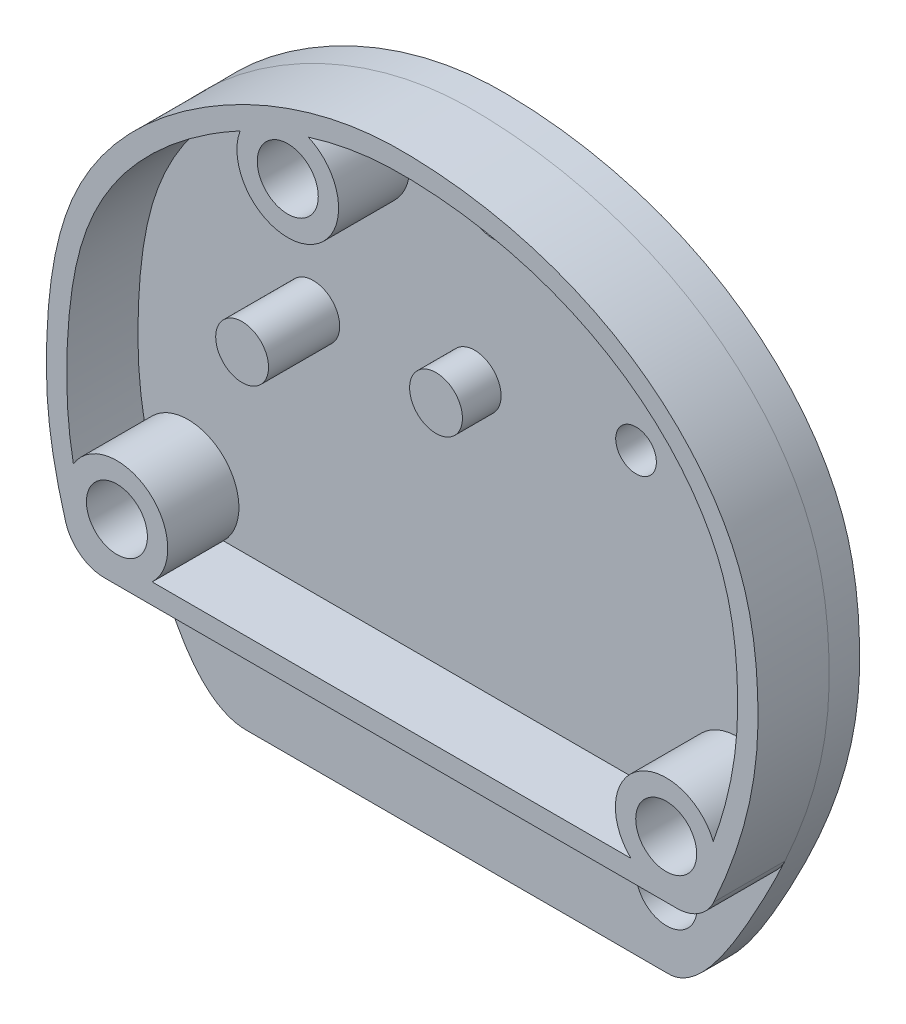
from build123d import *

# Parameters (mm, degrees)
ESQUISSE1_R      = 1.5
ESQUISSE1_R_2    = 1
EXTRUSION1_DEPTH = 1.5
EXTRUSION2_DEPTH = 3.5
ESQUISSE6_R      = 2.5
ESQUISSE6_R_2    = 1.5
EXTRUSION5_DEPTH = 3.5
ESQUISSE7_R      = 1.3
EXTRUSION6_DEPTH = 1.9
ESQUISSE7_3_R    = 1.3
EXTRUSION7_DEPTH = 3.5


with BuildPart() as part:
    # Esquisse1 → Extrusion1 (new body)
    with BuildSketch(Plane.XY):
        with BuildLine():
            add(Edge.make_bspline(
                [(-3.3971797, 11.394071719), (-3.395513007, 8.68662854), (-2.370480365, 4.05510623), (0.54355257, -2.679105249), (9.441377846, -2.667372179), (18.848986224, -2.667372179), (25.131099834, -2.678468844), (29.726189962, 4.570315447), (31.606721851, 10.113449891), (31.601256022, 15.563967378), (31.227270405, 20.572792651), (25.267008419, 27.659845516), (17.9103775, 29.32863948), (10.672863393, 29.320243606), (4.099449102, 27.082365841), (-2.82924192, 20.180658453), (-3.398796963, 14.021218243), (-3.3971797, 11.394071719)],
                knots=[0, 0, 0, 0, 0.075095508, 0.145707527, 0.145707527, 0.335877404, 0.335877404, 0.392344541, 0.508788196, 0.508788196, 0.555474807, 0.636980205, 0.746884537, 0.746884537, 0.838992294, 0.927131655, 1, 1, 1, 1], degree=3))
        make_face()
        with Locations((15.1028203, 25.824071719)):
            Circle(ESQUISSE1_R, mode=Mode.SUBTRACT)
        with Locations((22.1028203, 18.824071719)):
            Circle(ESQUISSE1_R_2, mode=Mode.SUBTRACT)
        with Locations((23.6028203, 0.824071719)):
            Circle(ESQUISSE1_R, mode=Mode.SUBTRACT)
    extrude(amount=-EXTRUSION1_DEPTH)

    # Esquisse2 → Extrusion2 (add)
    with BuildSketch(Plane(origin=(0, 0, 0), x_dir=(-1, 0, 0), z_dir=(0, 0, -1))):
        with BuildLine():
            Line((-27.606344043, 3.824071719), (0.534966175, 3.824071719))
            ThreePointArc((0.534966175, 3.824071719), (1.733661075, 4.223093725), (2.454050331, 5.260941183))
            add(Edge.make_bspline(
                [(2.454050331, 5.260941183), (3.077640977, 7.386066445), (3.395886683, 9.293643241), (3.3971797, 11.394071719), (3.398796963, 14.021218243), (2.82924192, 20.180658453), (-4.099449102, 27.082365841), (-10.672863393, 29.320243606), (-17.9103775, 29.32863948), (-25.267008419, 27.659845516), (-31.227270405, 20.572792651), (-31.601256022, 15.563967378), (-31.605785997, 11.046682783), (-30.874763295, 8.180411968), (-29.426982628, 4.996258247)],
                knots=[0.941741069, 0.941741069, 0.941741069, 0.941741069, 1, 1, 1, 1.072868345, 1.161007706, 1.253115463, 1.253115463, 1.363019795, 1.444525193, 1.491211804, 1.491211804, 1.579724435, 1.579724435, 1.579724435, 1.579724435], degree=3))
            ThreePointArc((-29.426982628, 4.996258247), (-28.689019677, 4.142461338), (-27.606344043, 3.824071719))
        make_face()
        with BuildLine():
            Line((-27.606344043, 4.824071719), (0.534966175, 4.824071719))
            ThreePointArc((0.534966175, 4.824071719), (1.134313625, 5.023582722), (1.494508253, 5.542506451))
            add(Edge.make_bspline(
                [(1.494508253, 5.542506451), (1.595317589, 5.886053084), (1.787642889, 6.587899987), (2.09094384, 7.917663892), (2.344077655, 9.542227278), (2.422397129, 11.531792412), (2.32309957, 14.398035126), (1.782093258, 17.858286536), (-0.064606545, 21.393226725), (-3.0583952, 24.3711127), (-6.734876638, 26.675611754), (-10.054210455, 27.878785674), (-12.737228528, 28.316987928), (-15.420569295, 28.351546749), (-18.96495247, 27.92462977), (-22.987467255, 26.578602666), (-26.522941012, 24.304922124), (-28.767929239, 21.652395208), (-29.919085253, 19.211855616), (-30.411831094, 17.200809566), (-30.576335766, 15.443602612), (-30.609458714, 14.108094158), (-30.574940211, 12.244634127), (-30.22292042, 10.06062662), (-29.496505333, 7.786140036), (-28.975016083, 6.449248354), (-28.671838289, 5.751446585), (-28.516663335, 5.410164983)],
                knots=[0.941741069, 0.941741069, 0.941741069, 0.941741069, 0.951709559, 0.96167805, 0.98161503, 1.00155201, 1.02148899, 1.06136295, 1.101236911, 1.141110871, 1.180984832, 1.220858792, 1.240795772, 1.260732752, 1.300606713, 1.340480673, 1.380354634, 1.420228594, 1.440165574, 1.460102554, 1.480039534, 1.490008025, 1.499976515, 1.539850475, 1.559787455, 1.569755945, 1.579724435, 1.579724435, 1.579724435, 1.579724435], degree=3))
            ThreePointArc((-28.516663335, 5.410164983), (-28.14768186, 4.983266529), (-27.606344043, 4.824071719))
        make_face(mode=Mode.SUBTRACT)
    extrude(amount=-EXTRUSION2_DEPTH)

    # Esquisse6 → Extrusion5 (add)
    # profile 1 of 3: a face of its own
    with BuildSketch(Plane(origin=(0, 0, 0), x_dir=(-1, 0, 0), z_dir=(0, 0, -1))):
        with Locations((-8.473809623, 25.324071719)):
            Circle(ESQUISSE6_R)
        with Locations((-8.473809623, 25.324071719)):
            Circle(ESQUISSE6_R_2, mode=Mode.SUBTRACT)
    # profile 2 of 3: a face of its own
    with BuildSketch(Plane(origin=(0, 0, 0), x_dir=(-1, 0, 0), z_dir=(0, 0, -1))):
        with Locations((-0.07081874, 6.624071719)):
            Circle(ESQUISSE6_R)
        with Locations((-0.07081874, 6.624071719)):
            Circle(ESQUISSE6_R_2, mode=Mode.SUBTRACT)
    # profile 3 of 3: a face of its own
    with BuildSketch(Plane(origin=(0, 0, 0), x_dir=(-1, 0, 0), z_dir=(0, 0, -1))):
        with Locations((-27.086630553, 6.624071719)):
            Circle(ESQUISSE6_R)
        with Locations((-27.086630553, 6.624071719)):
            Circle(ESQUISSE6_R_2, mode=Mode.SUBTRACT)
    extrude(amount=-EXTRUSION5_DEPTH)

    # Esquisse7 → Extrusion6 (add)
    with BuildSketch(Plane(origin=(0, 0, 0), x_dir=(-1, 0, 0), z_dir=(0, 0, -1))):
        with Locations((-14.165566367, 17.824071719)):
            Circle(ESQUISSE7_R)
    extrude(amount=-EXTRUSION6_DEPTH)

    # Esquisse7_3 → Extrusion7 (add)
    with BuildSketch(Plane(origin=(0, 0, 0), x_dir=(-1, 0, 0), z_dir=(0, 0, -1))):
        with Locations((-6.228312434, 16.824071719)):
            Circle(ESQUISSE7_3_R)
    extrude(amount=-EXTRUSION7_DEPTH)


solid = part.part
